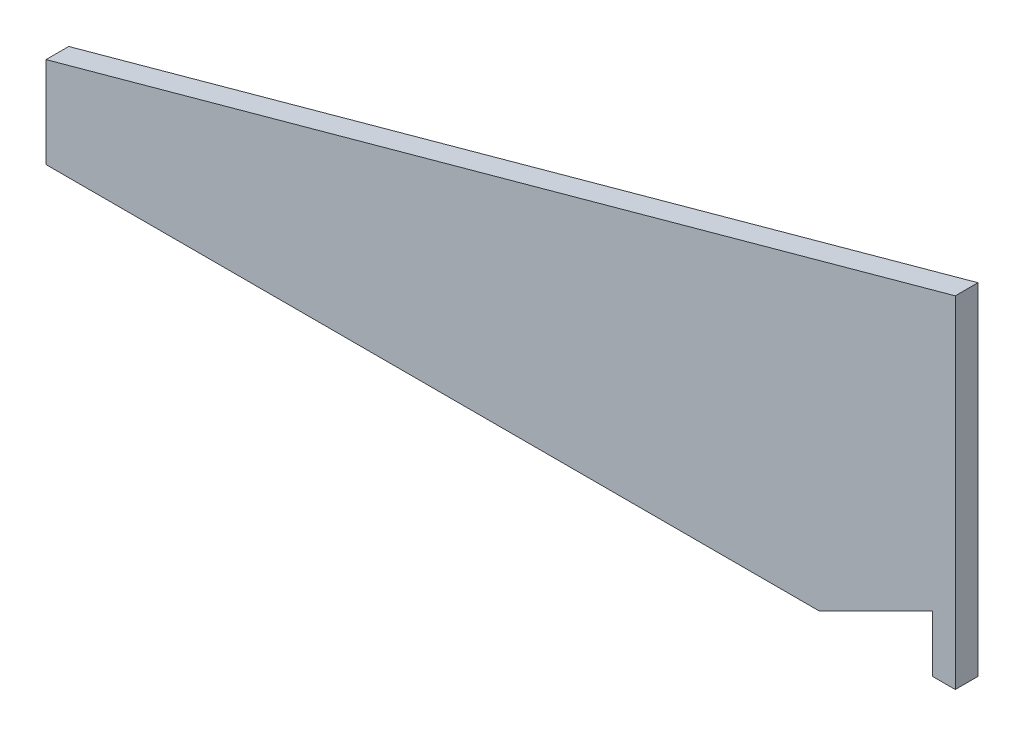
from build123d import *

# Parameters (mm, degrees)
BOSS_EXTRUDE1_DEPTH = 2


with BuildPart() as part:
    # Sketch1 → Boss-Extrude1 (new body)
    with BuildSketch(Plane.XY):
        Polygon((-31.510516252, 8), (-31.510516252, 0), (36.489483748, 0), (46.489483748, 5), (46.489483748, 0), (48.489483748, 0), (48.489483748, 30), align=None)
    extrude(amount=BOSS_EXTRUDE1_DEPTH)


solid = part.part
